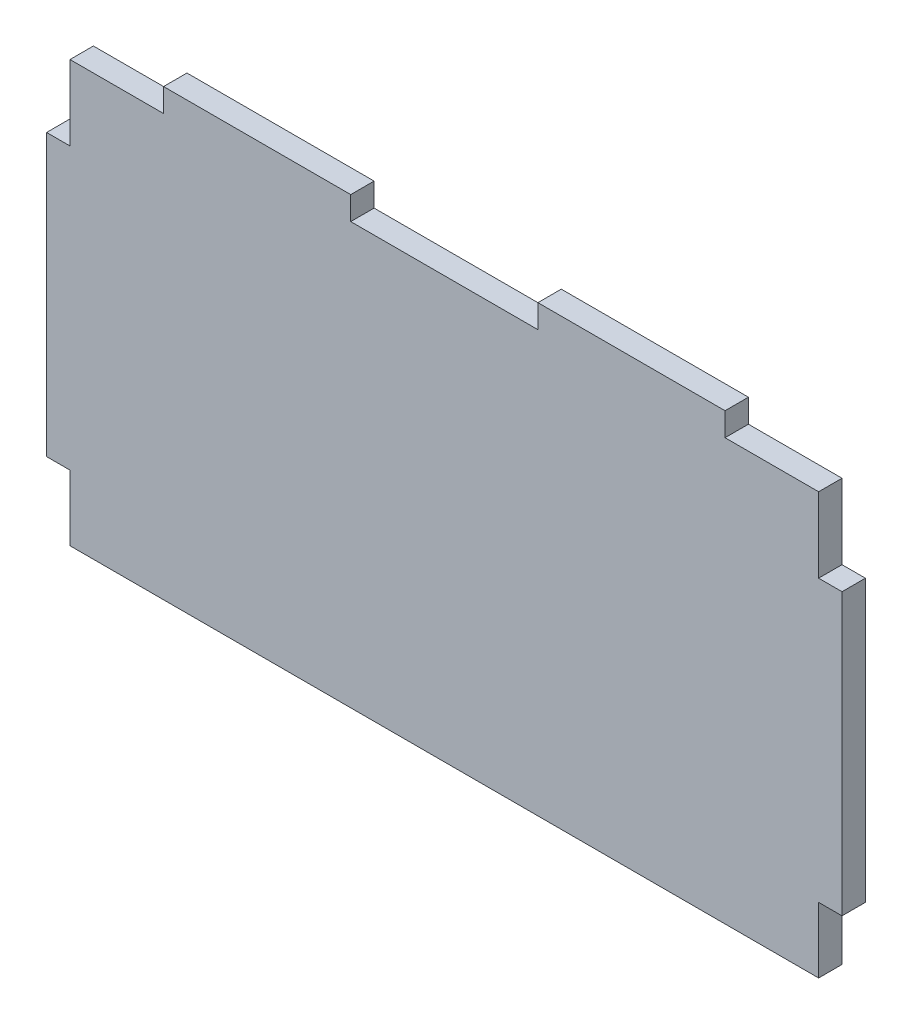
ISO-10303-21;
HEADER;
FILE_DESCRIPTION(('STEP AP214'),'2;1');
FILE_NAME('part.step','',(''),(''),'','','');
FILE_SCHEMA(('AUTOMOTIVE_DESIGN { 1 0 10303 214 1 1 1 1 }'));
ENDSEC;
DATA;
#1=APPLICATION_CONTEXT('core data for automotive mechanical design processes');
#2=APPLICATION_PROTOCOL_DEFINITION('international standard','automotive_design',2000,#1);
#3=PRODUCT_CONTEXT('',#1,'mechanical');
#4=PRODUCT('Part','Part','',(#3));
#5=PRODUCT_RELATED_PRODUCT_CATEGORY('part','',(#4));
#6=PRODUCT_DEFINITION_FORMATION('','',#4);
#7=PRODUCT_DEFINITION_CONTEXT('part definition',#1,'design');
#8=PRODUCT_DEFINITION('design','',#6,#7);
#9=PRODUCT_DEFINITION_SHAPE('','',#8);
#10=(LENGTH_UNIT() NAMED_UNIT(*) SI_UNIT(.MILLI.,.METRE.));
#11=(NAMED_UNIT(*) PLANE_ANGLE_UNIT() SI_UNIT($,.RADIAN.));
#12=(NAMED_UNIT(*) SI_UNIT($,.STERADIAN.) SOLID_ANGLE_UNIT());
#13=UNCERTAINTY_MEASURE_WITH_UNIT(LENGTH_MEASURE(1.E-05),#10,'distance_accuracy_value','');
#14=(GEOMETRIC_REPRESENTATION_CONTEXT(3) GLOBAL_UNCERTAINTY_ASSIGNED_CONTEXT((#13)) GLOBAL_UNIT_ASSIGNED_CONTEXT((#10,
#11,#12)) REPRESENTATION_CONTEXT('',''));
#15=CARTESIAN_POINT('',(0.,0.,0.));
#16=DIRECTION('',(0.,0.,1.));
#17=DIRECTION('',(1.,0.,0.));
#18=AXIS2_PLACEMENT_3D('',#15,#16,#17);
#19=CARTESIAN_POINT('',(-50.8,28.575,3.175));
#20=DIRECTION('',(0.,-1.,0.));
#21=DIRECTION('',(0.,0.,-1.));
#22=AXIS2_PLACEMENT_3D('',#19,#20,#21);
#23=PLANE('',#22);
#24=DIRECTION('',(0.,0.,1.));
#25=VECTOR('',#24,1.);
#26=CARTESIAN_POINT('',(12.7,28.575,0.));
#27=LINE('',#26,#25);
#28=CARTESIAN_POINT('',(12.7,28.575,0.));
#29=VERTEX_POINT('',#28);
#30=CARTESIAN_POINT('',(12.7,28.575,3.175));
#31=VERTEX_POINT('',#30);
#32=EDGE_CURVE('E197',#29,#31,#27,.T.);
#33=ORIENTED_EDGE('',*,*,#32,.F.);
#34=DIRECTION('',(-1.,0.,0.));
#35=VECTOR('',#34,1.);
#36=CARTESIAN_POINT('',(-50.8,28.575,0.));
#37=LINE('',#36,#35);
#38=CARTESIAN_POINT('',(-12.7,28.575,0.));
#39=VERTEX_POINT('',#38);
#40=EDGE_CURVE('E310',#29,#39,#37,.T.);
#41=ORIENTED_EDGE('',*,*,#40,.T.);
#42=DIRECTION('',(0.,0.,1.));
#43=VECTOR('',#42,1.);
#44=CARTESIAN_POINT('',(-12.7,28.575,0.));
#45=LINE('',#44,#43);
#46=CARTESIAN_POINT('',(-12.7,28.575,3.175));
#47=VERTEX_POINT('',#46);
#48=EDGE_CURVE('E181',#39,#47,#45,.T.);
#49=ORIENTED_EDGE('',*,*,#48,.T.);
#50=DIRECTION('',(-1.,0.,0.));
#51=VECTOR('',#50,1.);
#52=CARTESIAN_POINT('',(-50.8,28.575,3.175));
#53=LINE('',#52,#51);
#54=EDGE_CURVE('E49',#31,#47,#53,.T.);
#55=ORIENTED_EDGE('',*,*,#54,.F.);
#56=EDGE_LOOP('',(#33,#41,#49,#55));
#57=FACE_BOUND('',#56,.T.);
#58=ADVANCED_FACE('F34',(#57),#23,.F.);
#59=DIRECTION('',(0.,0.,1.));
#60=VECTOR('',#59,1.);
#61=CARTESIAN_POINT('',(-38.1,28.575,0.));
#62=LINE('',#61,#60);
#63=CARTESIAN_POINT('',(-38.1,28.575,0.));
#64=VERTEX_POINT('',#63);
#65=CARTESIAN_POINT('',(-38.1,28.575,3.175));
#66=VERTEX_POINT('',#65);
#67=EDGE_CURVE('E214',#64,#66,#62,.T.);
#68=ORIENTED_EDGE('',*,*,#67,.F.);
#69=CARTESIAN_POINT('',(-50.8,28.575,0.));
#70=VERTEX_POINT('',#69);
#71=EDGE_CURVE('E306',#64,#70,#37,.T.);
#72=ORIENTED_EDGE('',*,*,#71,.T.);
#73=DIRECTION('',(0.,0.,-1.));
#74=VECTOR('',#73,1.);
#75=CARTESIAN_POINT('',(-50.8,28.575,3.175));
#76=LINE('',#75,#74);
#77=CARTESIAN_POINT('',(-50.8,28.575,3.175));
#78=VERTEX_POINT('',#77);
#79=EDGE_CURVE('E42',#78,#70,#76,.T.);
#80=ORIENTED_EDGE('',*,*,#79,.F.);
#81=EDGE_CURVE('E293',#66,#78,#53,.T.);
#82=ORIENTED_EDGE('',*,*,#81,.F.);
#83=EDGE_LOOP('',(#68,#72,#80,#82));
#84=FACE_BOUND('',#83,.T.);
#85=ADVANCED_FACE('F352',(#84),#23,.F.);
#86=CARTESIAN_POINT('',(-50.8,28.575,3.175));
#87=DIRECTION('',(1.,0.,0.));
#88=DIRECTION('',(0.,0.,-1.));
#89=AXIS2_PLACEMENT_3D('',#86,#87,#88);
#90=PLANE('',#89);
#91=DIRECTION('',(0.,0.,-1.));
#92=VECTOR('',#91,1.);
#93=CARTESIAN_POINT('',(-50.8,18.415,0.));
#94=LINE('',#93,#92);
#95=CARTESIAN_POINT('',(-50.8,18.415,3.175));
#96=VERTEX_POINT('',#95);
#97=CARTESIAN_POINT('',(-50.8,18.415,0.));
#98=VERTEX_POINT('',#97);
#99=EDGE_CURVE('E240',#96,#98,#94,.T.);
#100=ORIENTED_EDGE('',*,*,#99,.F.);
#101=DIRECTION('',(0.,-1.,0.));
#102=VECTOR('',#101,1.);
#103=CARTESIAN_POINT('',(-50.8,28.575,3.175));
#104=LINE('',#103,#102);
#105=EDGE_CURVE('E298',#78,#96,#104,.T.);
#106=ORIENTED_EDGE('',*,*,#105,.F.);
#107=ORIENTED_EDGE('',*,*,#79,.T.);
#108=DIRECTION('',(0.,-1.,0.));
#109=VECTOR('',#108,1.);
#110=CARTESIAN_POINT('',(-50.8,28.575,0.));
#111=LINE('',#110,#109);
#112=EDGE_CURVE('E311',#70,#98,#111,.T.);
#113=ORIENTED_EDGE('',*,*,#112,.T.);
#114=EDGE_LOOP('',(#100,#106,#107,#113));
#115=FACE_BOUND('',#114,.T.);
#116=ADVANCED_FACE('F324',(#115),#90,.F.);
#117=DIRECTION('',(0.,0.,1.));
#118=VECTOR('',#117,1.);
#119=CARTESIAN_POINT('',(-50.8,-19.685,0.));
#120=LINE('',#119,#118);
#121=CARTESIAN_POINT('',(-50.8,-19.685,0.));
#122=VERTEX_POINT('',#121);
#123=CARTESIAN_POINT('',(-50.8,-19.685,3.175));
#124=VERTEX_POINT('',#123);
#125=EDGE_CURVE('E235',#122,#124,#120,.T.);
#126=ORIENTED_EDGE('',*,*,#125,.F.);
#127=CARTESIAN_POINT('',(-50.8,-28.575,0.));
#128=VERTEX_POINT('',#127);
#129=EDGE_CURVE('E309',#122,#128,#111,.T.);
#130=ORIENTED_EDGE('',*,*,#129,.T.);
#131=DIRECTION('',(0.,0.,-1.));
#132=VECTOR('',#131,1.);
#133=CARTESIAN_POINT('',(-50.8,-28.575,3.175));
#134=LINE('',#133,#132);
#135=CARTESIAN_POINT('',(-50.8,-28.575,3.175));
#136=VERTEX_POINT('',#135);
#137=EDGE_CURVE('E317',#136,#128,#134,.T.);
#138=ORIENTED_EDGE('',*,*,#137,.F.);
#139=EDGE_CURVE('E297',#124,#136,#104,.T.);
#140=ORIENTED_EDGE('',*,*,#139,.F.);
#141=EDGE_LOOP('',(#126,#130,#138,#140));
#142=FACE_BOUND('',#141,.T.);
#143=ADVANCED_FACE('F359',(#142),#90,.F.);
#144=CARTESIAN_POINT('',(50.8,28.575,3.175));
#145=DIRECTION('',(-1.,0.,0.));
#146=DIRECTION('',(0.,0.,1.));
#147=AXIS2_PLACEMENT_3D('',#144,#145,#146);
#148=PLANE('',#147);
#149=DIRECTION('',(0.,0.,1.));
#150=VECTOR('',#149,1.);
#151=CARTESIAN_POINT('',(50.8,18.415,3.175));
#152=LINE('',#151,#150);
#153=CARTESIAN_POINT('',(50.8,18.415,0.));
#154=VERTEX_POINT('',#153);
#155=CARTESIAN_POINT('',(50.8,18.415,3.175));
#156=VERTEX_POINT('',#155);
#157=EDGE_CURVE('E267',#154,#156,#152,.T.);
#158=ORIENTED_EDGE('',*,*,#157,.F.);
#159=DIRECTION('',(0.,1.,0.));
#160=VECTOR('',#159,1.);
#161=CARTESIAN_POINT('',(50.8,28.575,0.));
#162=LINE('',#161,#160);
#163=CARTESIAN_POINT('',(50.8,28.575,0.));
#164=VERTEX_POINT('',#163);
#165=EDGE_CURVE('E289',#154,#164,#162,.T.);
#166=ORIENTED_EDGE('',*,*,#165,.T.);
#167=DIRECTION('',(0.,0.,-1.));
#168=VECTOR('',#167,1.);
#169=CARTESIAN_POINT('',(50.8,28.575,3.175));
#170=LINE('',#169,#168);
#171=CARTESIAN_POINT('',(50.8,28.575,3.175));
#172=VERTEX_POINT('',#171);
#173=EDGE_CURVE('E11',#172,#164,#170,.T.);
#174=ORIENTED_EDGE('',*,*,#173,.F.);
#175=DIRECTION('',(0.,1.,0.));
#176=VECTOR('',#175,1.);
#177=CARTESIAN_POINT('',(50.8,28.575,3.175));
#178=LINE('',#177,#176);
#179=EDGE_CURVE('E294',#156,#172,#178,.T.);
#180=ORIENTED_EDGE('',*,*,#179,.F.);
#181=EDGE_LOOP('',(#158,#166,#174,#180));
#182=FACE_BOUND('',#181,.T.);
#183=ADVANCED_FACE('F36',(#182),#148,.F.);
#184=DIRECTION('',(0.,0.,-1.));
#185=VECTOR('',#184,1.);
#186=CARTESIAN_POINT('',(50.8,-19.685,3.17499999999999));
#187=LINE('',#186,#185);
#188=CARTESIAN_POINT('',(50.8,-19.685,3.175));
#189=VERTEX_POINT('',#188);
#190=CARTESIAN_POINT('',(50.8,-19.685,0.));
#191=VERTEX_POINT('',#190);
#192=EDGE_CURVE('E262',#189,#191,#187,.T.);
#193=ORIENTED_EDGE('',*,*,#192,.F.);
#194=CARTESIAN_POINT('',(50.8,-28.575,3.175));
#195=VERTEX_POINT('',#194);
#196=EDGE_CURVE('E290',#195,#189,#178,.T.);
#197=ORIENTED_EDGE('',*,*,#196,.F.);
#198=DIRECTION('',(0.,0.,-1.));
#199=VECTOR('',#198,1.);
#200=CARTESIAN_POINT('',(50.8,-28.575,3.175));
#201=LINE('',#200,#199);
#202=CARTESIAN_POINT('',(50.8,-28.575,0.));
#203=VERTEX_POINT('',#202);
#204=EDGE_CURVE('E303',#195,#203,#201,.T.);
#205=ORIENTED_EDGE('',*,*,#204,.T.);
#206=EDGE_CURVE('E304',#203,#191,#162,.T.);
#207=ORIENTED_EDGE('',*,*,#206,.T.);
#208=EDGE_LOOP('',(#193,#197,#205,#207));
#209=FACE_BOUND('',#208,.T.);
#210=ADVANCED_FACE('F363',(#209),#148,.F.);
#211=CARTESIAN_POINT('',(38.1,28.575,0.));
#212=VERTEX_POINT('',#211);
#213=EDGE_CURVE('E307',#164,#212,#37,.T.);
#214=ORIENTED_EDGE('',*,*,#213,.T.);
#215=DIRECTION('',(0.,0.,1.));
#216=VECTOR('',#215,1.);
#217=CARTESIAN_POINT('',(38.1,28.575,0.));
#218=LINE('',#217,#216);
#219=CARTESIAN_POINT('',(38.1,28.575,3.175));
#220=VERTEX_POINT('',#219);
#221=EDGE_CURVE('E57',#212,#220,#218,.T.);
#222=ORIENTED_EDGE('',*,*,#221,.T.);
#223=EDGE_CURVE('E295',#172,#220,#53,.T.);
#224=ORIENTED_EDGE('',*,*,#223,.F.);
#225=ORIENTED_EDGE('',*,*,#173,.T.);
#226=EDGE_LOOP('',(#214,#222,#224,#225));
#227=FACE_BOUND('',#226,.T.);
#228=ADVANCED_FACE('F354',(#227),#23,.F.);
#229=CARTESIAN_POINT('',(-50.8,-28.575,3.175));
#230=DIRECTION('',(0.,1.,0.));
#231=DIRECTION('',(0.,0.,1.));
#232=AXIS2_PLACEMENT_3D('',#229,#230,#231);
#233=PLANE('',#232);
#234=DIRECTION('',(1.,0.,0.));
#235=VECTOR('',#234,1.);
#236=CARTESIAN_POINT('',(-50.8,-28.575,0.));
#237=LINE('',#236,#235);
#238=EDGE_CURVE('E313',#128,#203,#237,.T.);
#239=ORIENTED_EDGE('',*,*,#238,.T.);
#240=ORIENTED_EDGE('',*,*,#204,.F.);
#241=DIRECTION('',(1.,0.,0.));
#242=VECTOR('',#241,1.);
#243=CARTESIAN_POINT('',(-50.8,-28.575,3.175));
#244=LINE('',#243,#242);
#245=EDGE_CURVE('E301',#136,#195,#244,.T.);
#246=ORIENTED_EDGE('',*,*,#245,.F.);
#247=ORIENTED_EDGE('',*,*,#137,.T.);
#248=EDGE_LOOP('',(#239,#240,#246,#247));
#249=FACE_BOUND('',#248,.T.);
#250=ADVANCED_FACE('F362',(#249),#233,.F.);
#251=CARTESIAN_POINT('',(0.,0.,3.175));
#252=DIRECTION('',(0.,0.,1.));
#253=DIRECTION('',(1.,0.,0.));
#254=AXIS2_PLACEMENT_3D('',#251,#252,#253);
#255=PLANE('',#254);
#256=ORIENTED_EDGE('',*,*,#196,.T.);
#257=DIRECTION('',(-1.,0.,0.));
#258=VECTOR('',#257,1.);
#259=CARTESIAN_POINT('',(53.975,-19.685,3.17499999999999));
#260=LINE('',#259,#258);
#261=CARTESIAN_POINT('',(53.975,-19.685,3.17499999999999));
#262=VERTEX_POINT('',#261);
#263=EDGE_CURVE('E286',#262,#189,#260,.T.);
#264=ORIENTED_EDGE('',*,*,#263,.F.);
#265=DIRECTION('',(0.,-1.,0.));
#266=VECTOR('',#265,1.);
#267=CARTESIAN_POINT('',(53.975,18.415,3.175));
#268=LINE('',#267,#266);
#269=CARTESIAN_POINT('',(53.975,18.415,3.175));
#270=VERTEX_POINT('',#269);
#271=EDGE_CURVE('E263',#270,#262,#268,.T.);
#272=ORIENTED_EDGE('',*,*,#271,.F.);
#273=DIRECTION('',(-1.,0.,0.));
#274=VECTOR('',#273,1.);
#275=CARTESIAN_POINT('',(53.975,18.415,3.175));
#276=LINE('',#275,#274);
#277=EDGE_CURVE('E273',#270,#156,#276,.T.);
#278=ORIENTED_EDGE('',*,*,#277,.T.);
#279=ORIENTED_EDGE('',*,*,#179,.T.);
#280=ORIENTED_EDGE('',*,*,#223,.T.);
#281=DIRECTION('',(0.,-1.,0.));
#282=VECTOR('',#281,1.);
#283=CARTESIAN_POINT('',(38.1,31.75,3.175));
#284=LINE('',#283,#282);
#285=CARTESIAN_POINT('',(38.1,31.75,3.175));
#286=VERTEX_POINT('',#285);
#287=EDGE_CURVE('E203',#286,#220,#284,.T.);
#288=ORIENTED_EDGE('',*,*,#287,.F.);
#289=DIRECTION('',(1.,0.,0.));
#290=VECTOR('',#289,1.);
#291=CARTESIAN_POINT('',(0.,31.75,3.175));
#292=LINE('',#291,#290);
#293=CARTESIAN_POINT('',(12.7,31.75,3.175));
#294=VERTEX_POINT('',#293);
#295=EDGE_CURVE('E195',#294,#286,#292,.T.);
#296=ORIENTED_EDGE('',*,*,#295,.F.);
#297=DIRECTION('',(0.,-1.,0.));
#298=VECTOR('',#297,1.);
#299=CARTESIAN_POINT('',(12.7,31.75,3.175));
#300=LINE('',#299,#298);
#301=EDGE_CURVE('E206',#294,#31,#300,.T.);
#302=ORIENTED_EDGE('',*,*,#301,.T.);
#303=ORIENTED_EDGE('',*,*,#54,.T.);
#304=DIRECTION('',(0.,-1.,0.));
#305=VECTOR('',#304,1.);
#306=CARTESIAN_POINT('',(-12.7,31.75,3.175));
#307=LINE('',#306,#305);
#308=CARTESIAN_POINT('',(-12.7,31.75,3.175));
#309=VERTEX_POINT('',#308);
#310=EDGE_CURVE('E220',#309,#47,#307,.T.);
#311=ORIENTED_EDGE('',*,*,#310,.F.);
#312=DIRECTION('',(1.,0.,0.));
#313=VECTOR('',#312,1.);
#314=CARTESIAN_POINT('',(0.,31.75,3.175));
#315=LINE('',#314,#313);
#316=CARTESIAN_POINT('',(-38.1,31.75,3.175));
#317=VERTEX_POINT('',#316);
#318=EDGE_CURVE('E218',#317,#309,#315,.T.);
#319=ORIENTED_EDGE('',*,*,#318,.F.);
#320=DIRECTION('',(0.,-1.,0.));
#321=VECTOR('',#320,1.);
#322=CARTESIAN_POINT('',(-38.1,31.75,3.175));
#323=LINE('',#322,#321);
#324=EDGE_CURVE('E226',#317,#66,#323,.T.);
#325=ORIENTED_EDGE('',*,*,#324,.T.);
#326=ORIENTED_EDGE('',*,*,#81,.T.);
#327=ORIENTED_EDGE('',*,*,#105,.T.);
#328=DIRECTION('',(1.,0.,0.));
#329=VECTOR('',#328,1.);
#330=CARTESIAN_POINT('',(-53.975,18.415,3.175));
#331=LINE('',#330,#329);
#332=CARTESIAN_POINT('',(-53.975,18.415,3.175));
#333=VERTEX_POINT('',#332);
#334=EDGE_CURVE('E253',#333,#96,#331,.T.);
#335=ORIENTED_EDGE('',*,*,#334,.F.);
#336=DIRECTION('',(0.,1.,0.));
#337=VECTOR('',#336,1.);
#338=CARTESIAN_POINT('',(-53.975,18.415,3.175));
#339=LINE('',#338,#337);
#340=CARTESIAN_POINT('',(-53.975,-19.685,3.175));
#341=VERTEX_POINT('',#340);
#342=EDGE_CURVE('E242',#341,#333,#339,.T.);
#343=ORIENTED_EDGE('',*,*,#342,.F.);
#344=DIRECTION('',(1.,0.,0.));
#345=VECTOR('',#344,1.);
#346=CARTESIAN_POINT('',(-53.975,-19.685,3.175));
#347=LINE('',#346,#345);
#348=EDGE_CURVE('E256',#341,#124,#347,.T.);
#349=ORIENTED_EDGE('',*,*,#348,.T.);
#350=ORIENTED_EDGE('',*,*,#139,.T.);
#351=ORIENTED_EDGE('',*,*,#245,.T.);
#352=EDGE_LOOP('',(#256,#264,#272,#278,#279,#280,#288,#296,#302,#303,#311,#319,#325,#326,#327,
#335,#343,#349,#350,#351));
#353=FACE_BOUND('',#352,.T.);
#354=ADVANCED_FACE('F336',(#353),#255,.T.);
#355=CARTESIAN_POINT('',(0.,0.,0.));
#356=DIRECTION('',(0.,0.,1.));
#357=DIRECTION('',(1.,0.,0.));
#358=AXIS2_PLACEMENT_3D('',#355,#356,#357);
#359=PLANE('',#358);
#360=ORIENTED_EDGE('',*,*,#206,.F.);
#361=ORIENTED_EDGE('',*,*,#238,.F.);
#362=ORIENTED_EDGE('',*,*,#129,.F.);
#363=DIRECTION('',(1.,0.,0.));
#364=VECTOR('',#363,1.);
#365=CARTESIAN_POINT('',(-53.975,-19.685,0.));
#366=LINE('',#365,#364);
#367=CARTESIAN_POINT('',(-53.975,-19.685,0.));
#368=VERTEX_POINT('',#367);
#369=EDGE_CURVE('E259',#368,#122,#366,.T.);
#370=ORIENTED_EDGE('',*,*,#369,.F.);
#371=DIRECTION('',(0.,-1.,0.));
#372=VECTOR('',#371,1.);
#373=CARTESIAN_POINT('',(-53.975,18.415,0.));
#374=LINE('',#373,#372);
#375=CARTESIAN_POINT('',(-53.975,18.415,0.));
#376=VERTEX_POINT('',#375);
#377=EDGE_CURVE('E236',#376,#368,#374,.T.);
#378=ORIENTED_EDGE('',*,*,#377,.F.);
#379=DIRECTION('',(1.,0.,0.));
#380=VECTOR('',#379,1.);
#381=CARTESIAN_POINT('',(-53.975,18.415,0.));
#382=LINE('',#381,#380);
#383=EDGE_CURVE('E246',#376,#98,#382,.T.);
#384=ORIENTED_EDGE('',*,*,#383,.T.);
#385=ORIENTED_EDGE('',*,*,#112,.F.);
#386=ORIENTED_EDGE('',*,*,#71,.F.);
#387=DIRECTION('',(0.,-1.,0.));
#388=VECTOR('',#387,1.);
#389=CARTESIAN_POINT('',(-38.1,31.75,0.));
#390=LINE('',#389,#388);
#391=CARTESIAN_POINT('',(-38.1,31.75,0.));
#392=VERTEX_POINT('',#391);
#393=EDGE_CURVE('E229',#392,#64,#390,.T.);
#394=ORIENTED_EDGE('',*,*,#393,.F.);
#395=DIRECTION('',(-1.,0.,0.));
#396=VECTOR('',#395,1.);
#397=CARTESIAN_POINT('',(0.,31.75,0.));
#398=LINE('',#397,#396);
#399=CARTESIAN_POINT('',(-12.7,31.75,0.));
#400=VERTEX_POINT('',#399);
#401=EDGE_CURVE('E213',#400,#392,#398,.T.);
#402=ORIENTED_EDGE('',*,*,#401,.F.);
#403=DIRECTION('',(0.,-1.,0.));
#404=VECTOR('',#403,1.);
#405=CARTESIAN_POINT('',(-12.7,31.75,0.));
#406=LINE('',#405,#404);
#407=EDGE_CURVE('E232',#400,#39,#406,.T.);
#408=ORIENTED_EDGE('',*,*,#407,.T.);
#409=ORIENTED_EDGE('',*,*,#40,.F.);
#410=DIRECTION('',(0.,-1.,0.));
#411=VECTOR('',#410,1.);
#412=CARTESIAN_POINT('',(12.7,31.75,0.));
#413=LINE('',#412,#411);
#414=CARTESIAN_POINT('',(12.7,31.75,0.));
#415=VERTEX_POINT('',#414);
#416=EDGE_CURVE('E182',#415,#29,#413,.T.);
#417=ORIENTED_EDGE('',*,*,#416,.F.);
#418=DIRECTION('',(-1.,0.,0.));
#419=VECTOR('',#418,1.);
#420=CARTESIAN_POINT('',(0.,31.75,0.));
#421=LINE('',#420,#419);
#422=CARTESIAN_POINT('',(38.1,31.75,0.));
#423=VERTEX_POINT('',#422);
#424=EDGE_CURVE('E185',#423,#415,#421,.T.);
#425=ORIENTED_EDGE('',*,*,#424,.F.);
#426=DIRECTION('',(0.,-1.,0.));
#427=VECTOR('',#426,1.);
#428=CARTESIAN_POINT('',(38.1,31.75,0.));
#429=LINE('',#428,#427);
#430=EDGE_CURVE('E173',#423,#212,#429,.T.);
#431=ORIENTED_EDGE('',*,*,#430,.T.);
#432=ORIENTED_EDGE('',*,*,#213,.F.);
#433=ORIENTED_EDGE('',*,*,#165,.F.);
#434=DIRECTION('',(-1.,0.,0.));
#435=VECTOR('',#434,1.);
#436=CARTESIAN_POINT('',(53.975,18.415,0.));
#437=LINE('',#436,#435);
#438=CARTESIAN_POINT('',(53.975,18.415,0.));
#439=VERTEX_POINT('',#438);
#440=EDGE_CURVE('E280',#439,#154,#437,.T.);
#441=ORIENTED_EDGE('',*,*,#440,.F.);
#442=DIRECTION('',(0.,1.,0.));
#443=VECTOR('',#442,1.);
#444=CARTESIAN_POINT('',(53.975,18.415,0.));
#445=LINE('',#444,#443);
#446=CARTESIAN_POINT('',(53.975,-19.685,0.));
#447=VERTEX_POINT('',#446);
#448=EDGE_CURVE('E269',#447,#439,#445,.T.);
#449=ORIENTED_EDGE('',*,*,#448,.F.);
#450=DIRECTION('',(-1.,0.,0.));
#451=VECTOR('',#450,1.);
#452=CARTESIAN_POINT('',(53.975,-19.685,0.));
#453=LINE('',#452,#451);
#454=EDGE_CURVE('E283',#447,#191,#453,.T.);
#455=ORIENTED_EDGE('',*,*,#454,.T.);
#456=EDGE_LOOP('',(#360,#361,#362,#370,#378,#384,#385,#386,#394,#402,#408,#409,#417,#425,#431,
#432,#433,#441,#449,#455));
#457=FACE_BOUND('',#456,.T.);
#458=ADVANCED_FACE('F187',(#457),#359,.F.);
#459=CARTESIAN_POINT('',(53.975,-19.685,3.17499999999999));
#460=DIRECTION('',(0.,1.,0.));
#461=DIRECTION('',(0.,0.,1.));
#462=AXIS2_PLACEMENT_3D('',#459,#460,#461);
#463=PLANE('',#462);
#464=ORIENTED_EDGE('',*,*,#192,.T.);
#465=ORIENTED_EDGE('',*,*,#454,.F.);
#466=DIRECTION('',(0.,0.,-1.));
#467=VECTOR('',#466,1.);
#468=CARTESIAN_POINT('',(53.975,-19.685,3.17499999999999));
#469=LINE('',#468,#467);
#470=EDGE_CURVE('E266',#262,#447,#469,.T.);
#471=ORIENTED_EDGE('',*,*,#470,.F.);
#472=ORIENTED_EDGE('',*,*,#263,.T.);
#473=EDGE_LOOP('',(#464,#465,#471,#472));
#474=FACE_BOUND('',#473,.T.);
#475=ADVANCED_FACE('F387',(#474),#463,.F.);
#476=CARTESIAN_POINT('',(53.975,18.415,3.175));
#477=DIRECTION('',(0.,-1.,0.));
#478=DIRECTION('',(0.,0.,-1.));
#479=AXIS2_PLACEMENT_3D('',#476,#477,#478);
#480=PLANE('',#479);
#481=ORIENTED_EDGE('',*,*,#157,.T.);
#482=ORIENTED_EDGE('',*,*,#277,.F.);
#483=DIRECTION('',(0.,0.,1.));
#484=VECTOR('',#483,1.);
#485=CARTESIAN_POINT('',(53.975,18.415,3.175));
#486=LINE('',#485,#484);
#487=EDGE_CURVE('E271',#439,#270,#486,.T.);
#488=ORIENTED_EDGE('',*,*,#487,.F.);
#489=ORIENTED_EDGE('',*,*,#440,.T.);
#490=EDGE_LOOP('',(#481,#482,#488,#489));
#491=FACE_BOUND('',#490,.T.);
#492=ADVANCED_FACE('F378',(#491),#480,.F.);
#493=CARTESIAN_POINT('',(53.975,0.,0.));
#494=DIRECTION('',(1.,0.,0.));
#495=DIRECTION('',(0.,0.,-1.));
#496=AXIS2_PLACEMENT_3D('',#493,#494,#495);
#497=PLANE('',#496);
#498=ORIENTED_EDGE('',*,*,#271,.T.);
#499=ORIENTED_EDGE('',*,*,#470,.T.);
#500=ORIENTED_EDGE('',*,*,#448,.T.);
#501=ORIENTED_EDGE('',*,*,#487,.T.);
#502=EDGE_LOOP('',(#498,#499,#500,#501));
#503=FACE_BOUND('',#502,.T.);
#504=ADVANCED_FACE('F382',(#503),#497,.T.);
#505=CARTESIAN_POINT('',(-53.975,-19.685,0.));
#506=DIRECTION('',(0.,1.,0.));
#507=DIRECTION('',(0.,0.,1.));
#508=AXIS2_PLACEMENT_3D('',#505,#506,#507);
#509=PLANE('',#508);
#510=ORIENTED_EDGE('',*,*,#125,.T.);
#511=ORIENTED_EDGE('',*,*,#348,.F.);
#512=DIRECTION('',(0.,0.,1.));
#513=VECTOR('',#512,1.);
#514=CARTESIAN_POINT('',(-53.975,-19.685,0.));
#515=LINE('',#514,#513);
#516=EDGE_CURVE('E239',#368,#341,#515,.T.);
#517=ORIENTED_EDGE('',*,*,#516,.F.);
#518=ORIENTED_EDGE('',*,*,#369,.T.);
#519=EDGE_LOOP('',(#510,#511,#517,#518));
#520=FACE_BOUND('',#519,.T.);
#521=ADVANCED_FACE('F395',(#520),#509,.F.);
#522=CARTESIAN_POINT('',(-53.975,18.415,0.));
#523=DIRECTION('',(0.,-1.,0.));
#524=DIRECTION('',(0.,0.,-1.));
#525=AXIS2_PLACEMENT_3D('',#522,#523,#524);
#526=PLANE('',#525);
#527=ORIENTED_EDGE('',*,*,#99,.T.);
#528=ORIENTED_EDGE('',*,*,#383,.F.);
#529=DIRECTION('',(0.,0.,-1.));
#530=VECTOR('',#529,1.);
#531=CARTESIAN_POINT('',(-53.975,18.415,0.));
#532=LINE('',#531,#530);
#533=EDGE_CURVE('E244',#333,#376,#532,.T.);
#534=ORIENTED_EDGE('',*,*,#533,.F.);
#535=ORIENTED_EDGE('',*,*,#334,.T.);
#536=EDGE_LOOP('',(#527,#528,#534,#535));
#537=FACE_BOUND('',#536,.T.);
#538=ADVANCED_FACE('F333',(#537),#526,.F.);
#539=CARTESIAN_POINT('',(-53.975,0.,0.));
#540=DIRECTION('',(-1.,0.,0.));
#541=DIRECTION('',(0.,0.,1.));
#542=AXIS2_PLACEMENT_3D('',#539,#540,#541);
#543=PLANE('',#542);
#544=ORIENTED_EDGE('',*,*,#377,.T.);
#545=ORIENTED_EDGE('',*,*,#516,.T.);
#546=ORIENTED_EDGE('',*,*,#342,.T.);
#547=ORIENTED_EDGE('',*,*,#533,.T.);
#548=EDGE_LOOP('',(#544,#545,#546,#547));
#549=FACE_BOUND('',#548,.T.);
#550=ADVANCED_FACE('F398',(#549),#543,.T.);
#551=CARTESIAN_POINT('',(-12.7,31.75,0.));
#552=DIRECTION('',(1.,0.,0.));
#553=DIRECTION('',(0.,0.,-1.));
#554=AXIS2_PLACEMENT_3D('',#551,#552,#553);
#555=PLANE('',#554);
#556=ORIENTED_EDGE('',*,*,#48,.F.);
#557=ORIENTED_EDGE('',*,*,#407,.F.);
#558=DIRECTION('',(0.,0.,1.));
#559=VECTOR('',#558,1.);
#560=CARTESIAN_POINT('',(-12.7,31.75,0.));
#561=LINE('',#560,#559);
#562=EDGE_CURVE('E210',#400,#309,#561,.T.);
#563=ORIENTED_EDGE('',*,*,#562,.T.);
#564=ORIENTED_EDGE('',*,*,#310,.T.);
#565=EDGE_LOOP('',(#556,#557,#563,#564));
#566=FACE_BOUND('',#565,.T.);
#567=ADVANCED_FACE('F344',(#566),#555,.T.);
#568=CARTESIAN_POINT('',(-38.1,31.75,0.));
#569=DIRECTION('',(1.,0.,0.));
#570=DIRECTION('',(0.,0.,-1.));
#571=AXIS2_PLACEMENT_3D('',#568,#569,#570);
#572=PLANE('',#571);
#573=ORIENTED_EDGE('',*,*,#67,.T.);
#574=ORIENTED_EDGE('',*,*,#324,.F.);
#575=DIRECTION('',(0.,0.,1.));
#576=VECTOR('',#575,1.);
#577=CARTESIAN_POINT('',(-38.1,31.75,0.));
#578=LINE('',#577,#576);
#579=EDGE_CURVE('E216',#392,#317,#578,.T.);
#580=ORIENTED_EDGE('',*,*,#579,.F.);
#581=ORIENTED_EDGE('',*,*,#393,.T.);
#582=EDGE_LOOP('',(#573,#574,#580,#581));
#583=FACE_BOUND('',#582,.T.);
#584=ADVANCED_FACE('F351',(#583),#572,.F.);
#585=CARTESIAN_POINT('',(0.,31.75,0.));
#586=DIRECTION('',(0.,1.,0.));
#587=DIRECTION('',(0.,0.,1.));
#588=AXIS2_PLACEMENT_3D('',#585,#586,#587);
#589=PLANE('',#588);
#590=ORIENTED_EDGE('',*,*,#562,.F.);
#591=ORIENTED_EDGE('',*,*,#401,.T.);
#592=ORIENTED_EDGE('',*,*,#579,.T.);
#593=ORIENTED_EDGE('',*,*,#318,.T.);
#594=EDGE_LOOP('',(#590,#591,#592,#593));
#595=FACE_BOUND('',#594,.T.);
#596=ADVANCED_FACE('F348',(#595),#589,.T.);
#597=CARTESIAN_POINT('',(38.1,31.75,0.));
#598=DIRECTION('',(1.,0.,0.));
#599=DIRECTION('',(0.,0.,-1.));
#600=AXIS2_PLACEMENT_3D('',#597,#598,#599);
#601=PLANE('',#600);
#602=ORIENTED_EDGE('',*,*,#221,.F.);
#603=ORIENTED_EDGE('',*,*,#430,.F.);
#604=DIRECTION('',(0.,0.,1.));
#605=VECTOR('',#604,1.);
#606=CARTESIAN_POINT('',(38.1,31.75,0.));
#607=LINE('',#606,#605);
#608=EDGE_CURVE('E178',#423,#286,#607,.T.);
#609=ORIENTED_EDGE('',*,*,#608,.T.);
#610=ORIENTED_EDGE('',*,*,#287,.T.);
#611=EDGE_LOOP('',(#602,#603,#609,#610));
#612=FACE_BOUND('',#611,.T.);
#613=ADVANCED_FACE('F175',(#612),#601,.T.);
#614=CARTESIAN_POINT('',(12.7,31.75,0.));
#615=DIRECTION('',(1.,0.,0.));
#616=DIRECTION('',(0.,0.,-1.));
#617=AXIS2_PLACEMENT_3D('',#614,#615,#616);
#618=PLANE('',#617);
#619=ORIENTED_EDGE('',*,*,#32,.T.);
#620=ORIENTED_EDGE('',*,*,#301,.F.);
#621=DIRECTION('',(0.,0.,1.));
#622=VECTOR('',#621,1.);
#623=CARTESIAN_POINT('',(12.7,31.75,0.));
#624=LINE('',#623,#622);
#625=EDGE_CURVE('E191',#415,#294,#624,.T.);
#626=ORIENTED_EDGE('',*,*,#625,.F.);
#627=ORIENTED_EDGE('',*,*,#416,.T.);
#628=EDGE_LOOP('',(#619,#620,#626,#627));
#629=FACE_BOUND('',#628,.T.);
#630=ADVANCED_FACE('F519',(#629),#618,.F.);
#631=CARTESIAN_POINT('',(0.,31.75,0.));
#632=DIRECTION('',(0.,1.,0.));
#633=DIRECTION('',(0.,0.,1.));
#634=AXIS2_PLACEMENT_3D('',#631,#632,#633);
#635=PLANE('',#634);
#636=ORIENTED_EDGE('',*,*,#608,.F.);
#637=ORIENTED_EDGE('',*,*,#424,.T.);
#638=ORIENTED_EDGE('',*,*,#625,.T.);
#639=ORIENTED_EDGE('',*,*,#295,.T.);
#640=EDGE_LOOP('',(#636,#637,#638,#639));
#641=FACE_BOUND('',#640,.T.);
#642=ADVANCED_FACE('F193',(#641),#635,.T.);
#643=CLOSED_SHELL('',(#58,#85,#116,#143,#183,#210,#228,#250,#354,#458,#475,#492,#504,#521,#538,
#550,#567,#584,#596,#613,#630,#642));
#644=MANIFOLD_SOLID_BREP('B2',#643);
#645=ADVANCED_BREP_SHAPE_REPRESENTATION('',(#18,#644),#14);
#646=SHAPE_DEFINITION_REPRESENTATION(#9,#645);
ENDSEC;
END-ISO-10303-21;
